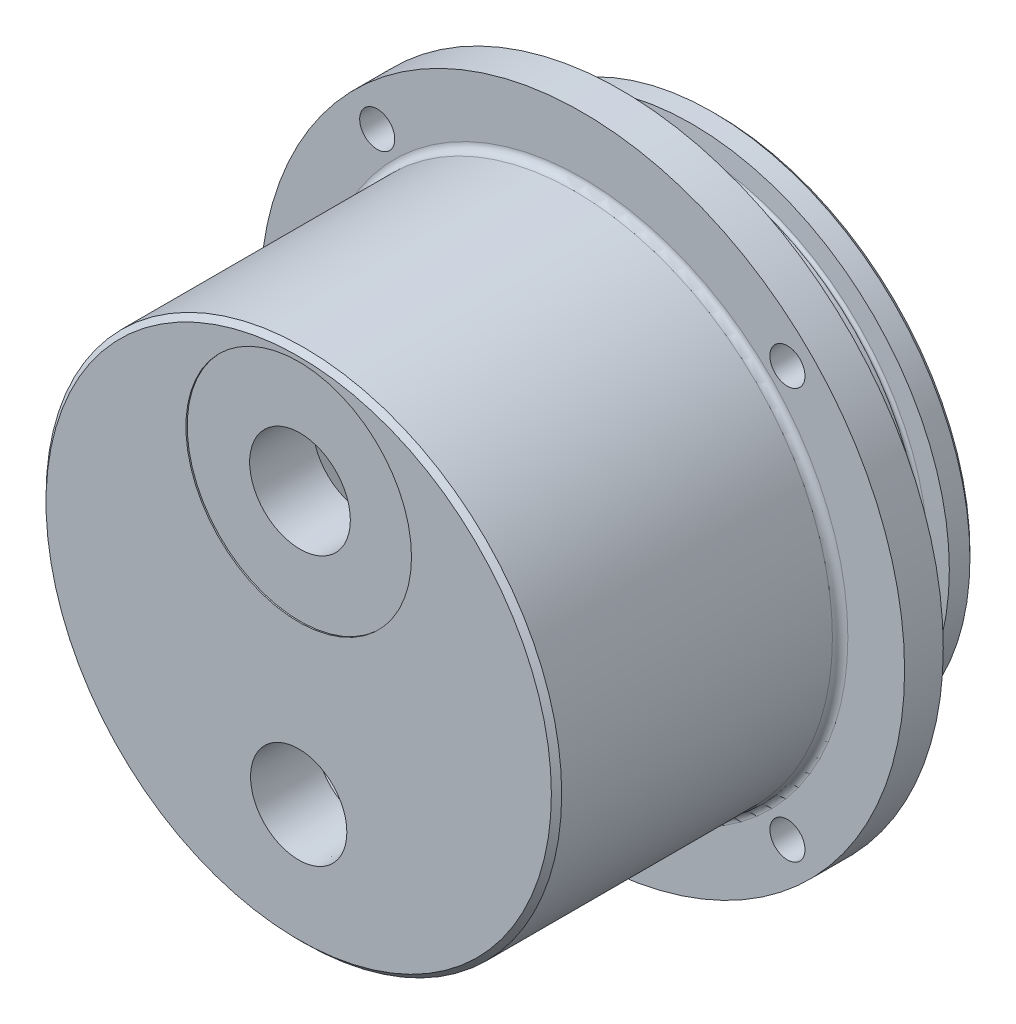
ISO-10303-21;
HEADER;
FILE_DESCRIPTION(('STEP AP214'),'2;1');
FILE_NAME('part.step','',(''),(''),'','','');
FILE_SCHEMA(('AUTOMOTIVE_DESIGN { 1 0 10303 214 1 1 1 1 }'));
ENDSEC;
DATA;
#1=APPLICATION_CONTEXT('core data for automotive mechanical design processes');
#2=APPLICATION_PROTOCOL_DEFINITION('international standard','automotive_design',2000,#1);
#3=PRODUCT_CONTEXT('',#1,'mechanical');
#4=PRODUCT('Part','Part','',(#3));
#5=PRODUCT_RELATED_PRODUCT_CATEGORY('part','',(#4));
#6=PRODUCT_DEFINITION_FORMATION('','',#4);
#7=PRODUCT_DEFINITION_CONTEXT('part definition',#1,'design');
#8=PRODUCT_DEFINITION('design','',#6,#7);
#9=PRODUCT_DEFINITION_SHAPE('','',#8);
#10=(LENGTH_UNIT() NAMED_UNIT(*) SI_UNIT(.MILLI.,.METRE.));
#11=(NAMED_UNIT(*) PLANE_ANGLE_UNIT() SI_UNIT($,.RADIAN.));
#12=(NAMED_UNIT(*) SI_UNIT($,.STERADIAN.) SOLID_ANGLE_UNIT());
#13=UNCERTAINTY_MEASURE_WITH_UNIT(LENGTH_MEASURE(1.E-05),#10,'distance_accuracy_value','');
#14=(GEOMETRIC_REPRESENTATION_CONTEXT(3) GLOBAL_UNCERTAINTY_ASSIGNED_CONTEXT((#13)) GLOBAL_UNIT_ASSIGNED_CONTEXT((#10,
#11,#12)) REPRESENTATION_CONTEXT('',''));
#15=CARTESIAN_POINT('',(0.,0.,0.));
#16=DIRECTION('',(0.,0.,1.));
#17=DIRECTION('',(1.,0.,0.));
#18=AXIS2_PLACEMENT_3D('',#15,#16,#17);
#19=CARTESIAN_POINT('',(0.,13.335,31.75));
#20=DIRECTION('',(0.,0.,1.));
#21=DIRECTION('',(1.,0.,0.));
#22=AXIS2_PLACEMENT_3D('',#19,#20,#21);
#23=CYLINDRICAL_SURFACE('',#22,4.96061999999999);
#24=CARTESIAN_POINT('',(0.,13.335,25.4));
#25=DIRECTION('',(0.,0.,1.));
#26=DIRECTION('',(1.,0.,0.));
#27=AXIS2_PLACEMENT_3D('',#24,#25,#26);
#28=CIRCLE('',#27,4.96061999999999);
#29=CARTESIAN_POINT('',(0.321857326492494,18.2851675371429,25.4));
#30=VERTEX_POINT('',#29);
#31=CARTESIAN_POINT('',(-0.321857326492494,18.2851675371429,25.4));
#32=VERTEX_POINT('',#31);
#33=EDGE_CURVE('E84',#30,#32,#28,.T.);
#34=ORIENTED_EDGE('',*,*,#33,.F.);
#35=EDGE_CURVE('E94',#32,#30,#28,.T.);
#36=ORIENTED_EDGE('',*,*,#35,.F.);
#37=EDGE_LOOP('',(#34,#36));
#38=FACE_BOUND('',#37,.T.);
#39=CARTESIAN_POINT('',(0.,13.335,31.623));
#40=DIRECTION('',(0.,0.,1.));
#41=DIRECTION('',(1.,0.,0.));
#42=AXIS2_PLACEMENT_3D('',#39,#40,#41);
#43=CIRCLE('',#42,4.96061999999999);
#44=CARTESIAN_POINT('',(4.96061999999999,13.335,31.623));
#45=VERTEX_POINT('',#44);
#46=EDGE_CURVE('E177',#45,#45,#43,.F.);
#47=ORIENTED_EDGE('',*,*,#46,.F.);
#48=EDGE_LOOP('',(#47));
#49=FACE_BOUND('',#48,.T.);
#50=ADVANCED_FACE('F53',(#38,#49),#23,.F.);
#51=CARTESIAN_POINT('',(0.,0.,25.4));
#52=DIRECTION('',(0.,0.,-1.));
#53=DIRECTION('',(-1.,0.,0.));
#54=AXIS2_PLACEMENT_3D('',#51,#52,#53);
#55=CYLINDRICAL_SURFACE('',#54,31.75);
#56=CARTESIAN_POINT('',(0.,0.,0.));
#57=DIRECTION('',(0.,0.,1.));
#58=DIRECTION('',(1.,0.,0.));
#59=AXIS2_PLACEMENT_3D('',#56,#57,#58);
#60=CIRCLE('',#59,31.75);
#61=CARTESIAN_POINT('',(31.75,0.,0.));
#62=VERTEX_POINT('',#61);
#63=EDGE_CURVE('E148',#62,#62,#60,.T.);
#64=ORIENTED_EDGE('',*,*,#63,.T.);
#65=EDGE_LOOP('',(#64));
#66=FACE_BOUND('',#65,.T.);
#67=CARTESIAN_POINT('',(0.,0.,3.81));
#68=DIRECTION('',(0.,0.,1.));
#69=DIRECTION('',(1.,0.,0.));
#70=AXIS2_PLACEMENT_3D('',#67,#68,#69);
#71=CIRCLE('',#70,31.75);
#72=CARTESIAN_POINT('',(31.75,0.,3.81));
#73=VERTEX_POINT('',#72);
#74=EDGE_CURVE('E115',#73,#73,#71,.T.);
#75=ORIENTED_EDGE('',*,*,#74,.F.);
#76=EDGE_LOOP('',(#75));
#77=FACE_BOUND('',#76,.T.);
#78=ADVANCED_FACE('F191',(#66,#77),#55,.T.);
#79=CARTESIAN_POINT('',(-20.2055762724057,20.2055762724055,-9.525));
#80=DIRECTION('',(0.,0.,1.));
#81=DIRECTION('',(1.,0.,0.));
#82=AXIS2_PLACEMENT_3D('',#79,#80,#81);
#83=CYLINDRICAL_SURFACE('',#82,1.7272);
#84=CARTESIAN_POINT('',(-20.2055762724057,20.2055762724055,0.));
#85=DIRECTION('',(0.,0.,1.));
#86=DIRECTION('',(1.,0.,0.));
#87=AXIS2_PLACEMENT_3D('',#84,#85,#86);
#88=CIRCLE('',#87,1.7272);
#89=CARTESIAN_POINT('',(-18.4783762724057,20.2055762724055,0.));
#90=VERTEX_POINT('',#89);
#91=EDGE_CURVE('E145',#90,#90,#88,.T.);
#92=ORIENTED_EDGE('',*,*,#91,.F.);
#93=EDGE_LOOP('',(#92));
#94=FACE_BOUND('',#93,.T.);
#95=CARTESIAN_POINT('',(-20.2055762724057,20.2055762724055,3.81));
#96=DIRECTION('',(0.,0.,1.));
#97=DIRECTION('',(1.,0.,0.));
#98=AXIS2_PLACEMENT_3D('',#95,#96,#97);
#99=CIRCLE('',#98,1.7272);
#100=CARTESIAN_POINT('',(-18.4783762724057,20.2055762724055,3.81));
#101=VERTEX_POINT('',#100);
#102=EDGE_CURVE('E112',#101,#101,#99,.F.);
#103=ORIENTED_EDGE('',*,*,#102,.F.);
#104=EDGE_LOOP('',(#103));
#105=FACE_BOUND('',#104,.T.);
#106=ADVANCED_FACE('F284',(#94,#105),#83,.F.);
#107=CARTESIAN_POINT('',(20.2055762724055,20.2055762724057,-9.525));
#108=DIRECTION('',(0.,0.,1.));
#109=DIRECTION('',(1.,0.,0.));
#110=AXIS2_PLACEMENT_3D('',#107,#108,#109);
#111=CYLINDRICAL_SURFACE('',#110,1.7272);
#112=CARTESIAN_POINT('',(20.2055762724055,20.2055762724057,0.));
#113=DIRECTION('',(0.,0.,1.));
#114=DIRECTION('',(1.,0.,0.));
#115=AXIS2_PLACEMENT_3D('',#112,#113,#114);
#116=CIRCLE('',#115,1.7272);
#117=CARTESIAN_POINT('',(21.9327762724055,20.2055762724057,0.));
#118=VERTEX_POINT('',#117);
#119=EDGE_CURVE('E142',#118,#118,#116,.T.);
#120=ORIENTED_EDGE('',*,*,#119,.F.);
#121=EDGE_LOOP('',(#120));
#122=FACE_BOUND('',#121,.T.);
#123=CARTESIAN_POINT('',(20.2055762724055,20.2055762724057,3.81));
#124=DIRECTION('',(0.,0.,1.));
#125=DIRECTION('',(1.,0.,0.));
#126=AXIS2_PLACEMENT_3D('',#123,#124,#125);
#127=CIRCLE('',#126,1.7272);
#128=CARTESIAN_POINT('',(21.9327762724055,20.2055762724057,3.81));
#129=VERTEX_POINT('',#128);
#130=EDGE_CURVE('E109',#129,#129,#127,.F.);
#131=ORIENTED_EDGE('',*,*,#130,.F.);
#132=EDGE_LOOP('',(#131));
#133=FACE_BOUND('',#132,.T.);
#134=ADVANCED_FACE('F280',(#122,#133),#111,.F.);
#135=CARTESIAN_POINT('',(-20.2055762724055,-20.2055762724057,-9.525));
#136=DIRECTION('',(0.,0.,1.));
#137=DIRECTION('',(1.,0.,0.));
#138=AXIS2_PLACEMENT_3D('',#135,#136,#137);
#139=CYLINDRICAL_SURFACE('',#138,1.7272);
#140=CARTESIAN_POINT('',(-20.2055762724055,-20.2055762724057,0.));
#141=DIRECTION('',(0.,0.,1.));
#142=DIRECTION('',(1.,0.,0.));
#143=AXIS2_PLACEMENT_3D('',#140,#141,#142);
#144=CIRCLE('',#143,1.7272);
#145=CARTESIAN_POINT('',(-18.4783762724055,-20.2055762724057,0.));
#146=VERTEX_POINT('',#145);
#147=EDGE_CURVE('E139',#146,#146,#144,.T.);
#148=ORIENTED_EDGE('',*,*,#147,.F.);
#149=EDGE_LOOP('',(#148));
#150=FACE_BOUND('',#149,.T.);
#151=CARTESIAN_POINT('',(-20.2055762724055,-20.2055762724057,3.81));
#152=DIRECTION('',(0.,0.,1.));
#153=DIRECTION('',(1.,0.,0.));
#154=AXIS2_PLACEMENT_3D('',#151,#152,#153);
#155=CIRCLE('',#154,1.7272);
#156=CARTESIAN_POINT('',(-18.4783762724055,-20.2055762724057,3.81));
#157=VERTEX_POINT('',#156);
#158=EDGE_CURVE('E102',#157,#157,#155,.F.);
#159=ORIENTED_EDGE('',*,*,#158,.F.);
#160=EDGE_LOOP('',(#159));
#161=FACE_BOUND('',#160,.T.);
#162=ADVANCED_FACE('F276',(#150,#161),#139,.F.);
#163=CARTESIAN_POINT('',(20.2055762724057,-20.2055762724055,-9.525));
#164=DIRECTION('',(0.,0.,1.));
#165=DIRECTION('',(1.,0.,0.));
#166=AXIS2_PLACEMENT_3D('',#163,#164,#165);
#167=CYLINDRICAL_SURFACE('',#166,1.7272);
#168=CARTESIAN_POINT('',(20.2055762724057,-20.2055762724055,0.));
#169=DIRECTION('',(0.,0.,1.));
#170=DIRECTION('',(1.,0.,0.));
#171=AXIS2_PLACEMENT_3D('',#168,#169,#170);
#172=CIRCLE('',#171,1.7272);
#173=CARTESIAN_POINT('',(21.9327762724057,-20.2055762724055,0.));
#174=VERTEX_POINT('',#173);
#175=EDGE_CURVE('E136',#174,#174,#172,.T.);
#176=ORIENTED_EDGE('',*,*,#175,.F.);
#177=EDGE_LOOP('',(#176));
#178=FACE_BOUND('',#177,.T.);
#179=CARTESIAN_POINT('',(20.2055762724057,-20.2055762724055,3.81));
#180=DIRECTION('',(0.,0.,1.));
#181=DIRECTION('',(1.,0.,0.));
#182=AXIS2_PLACEMENT_3D('',#179,#180,#181);
#183=CIRCLE('',#182,1.7272);
#184=CARTESIAN_POINT('',(21.9327762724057,-20.2055762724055,3.81));
#185=VERTEX_POINT('',#184);
#186=EDGE_CURVE('E100',#185,#185,#183,.F.);
#187=ORIENTED_EDGE('',*,*,#186,.F.);
#188=EDGE_LOOP('',(#187));
#189=FACE_BOUND('',#188,.T.);
#190=ADVANCED_FACE('F272',(#178,#189),#167,.F.);
#191=CARTESIAN_POINT('',(0.,0.,-9.525));
#192=DIRECTION('',(0.,0.,1.));
#193=DIRECTION('',(1.,0.,0.));
#194=AXIS2_PLACEMENT_3D('',#191,#192,#193);
#195=CYLINDRICAL_SURFACE('',#194,25.3619);
#196=CARTESIAN_POINT('',(0.,0.,-6.985));
#197=DIRECTION('',(0.,0.,-1.));
#198=DIRECTION('',(-1.,0.,0.));
#199=AXIS2_PLACEMENT_3D('',#196,#197,#198);
#200=CIRCLE('',#199,25.3619);
#201=CARTESIAN_POINT('',(25.3619,0.,-6.985));
#202=VERTEX_POINT('',#201);
#203=EDGE_CURVE('E127',#202,#202,#200,.T.);
#204=CARTESIAN_POINT('',(0.,0.,-9.017));
#205=DIRECTION('',(0.,0.,1.));
#206=DIRECTION('',(1.,0.,0.));
#207=AXIS2_PLACEMENT_3D('',#204,#205,#206);
#208=CIRCLE('',#207,25.3619);
#209=CARTESIAN_POINT('',(25.3619,0.,-9.017));
#210=VERTEX_POINT('',#209);
#211=EDGE_CURVE('E154',#210,#210,#208,.T.);
#212=CARTESIAN_POINT('',(25.3619,0.,-6.985));
#213=CARTESIAN_POINT('',(25.3619,0.,-7.00616666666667));
#214=CARTESIAN_POINT('',(25.3619,0.,-7.02733333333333));
#215=CARTESIAN_POINT('',(25.3619,0.,-7.06966666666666));
#216=CARTESIAN_POINT('',(25.3619,0.,-7.09083333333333));
#217=CARTESIAN_POINT('',(25.3619,0.,-7.13316666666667));
#218=CARTESIAN_POINT('',(25.3619,0.,-7.15433333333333));
#219=CARTESIAN_POINT('',(25.3619,0.,-7.19666666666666));
#220=CARTESIAN_POINT('',(25.3619,0.,-7.21783333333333));
#221=CARTESIAN_POINT('',(25.3619,0.,-7.26016666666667));
#222=CARTESIAN_POINT('',(25.3619,0.,-7.28133333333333));
#223=CARTESIAN_POINT('',(25.3619,0.,-7.32366666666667));
#224=CARTESIAN_POINT('',(25.3619,0.,-7.34483333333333));
#225=CARTESIAN_POINT('',(25.3619,0.,-7.38716666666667));
#226=CARTESIAN_POINT('',(25.3619,0.,-7.40833333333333));
#227=CARTESIAN_POINT('',(25.3619,0.,-7.45066666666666));
#228=CARTESIAN_POINT('',(25.3619,0.,-7.47183333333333));
#229=CARTESIAN_POINT('',(25.3619,0.,-7.51416666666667));
#230=CARTESIAN_POINT('',(25.3619,0.,-7.53533333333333));
#231=CARTESIAN_POINT('',(25.3619,0.,-7.57766666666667));
#232=CARTESIAN_POINT('',(25.3619,0.,-7.59883333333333));
#233=CARTESIAN_POINT('',(25.3619,0.,-7.64116666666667));
#234=CARTESIAN_POINT('',(25.3619,0.,-7.66233333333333));
#235=CARTESIAN_POINT('',(25.3619,0.,-7.70466666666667));
#236=CARTESIAN_POINT('',(25.3619,0.,-7.72583333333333));
#237=CARTESIAN_POINT('',(25.3619,0.,-7.76816666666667));
#238=CARTESIAN_POINT('',(25.3619,0.,-7.78933333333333));
#239=CARTESIAN_POINT('',(25.3619,0.,-7.83166666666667));
#240=CARTESIAN_POINT('',(25.3619,0.,-7.85283333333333));
#241=CARTESIAN_POINT('',(25.3619,0.,-7.89516666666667));
#242=CARTESIAN_POINT('',(25.3619,0.,-7.91633333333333));
#243=CARTESIAN_POINT('',(25.3619,0.,-7.95866666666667));
#244=CARTESIAN_POINT('',(25.3619,0.,-7.97983333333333));
#245=CARTESIAN_POINT('',(25.3619,0.,-8.02216666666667));
#246=CARTESIAN_POINT('',(25.3619,0.,-8.04333333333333));
#247=CARTESIAN_POINT('',(25.3619,0.,-8.08566666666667));
#248=CARTESIAN_POINT('',(25.3619,0.,-8.10683333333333));
#249=CARTESIAN_POINT('',(25.3619,0.,-8.14916666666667));
#250=CARTESIAN_POINT('',(25.3619,0.,-8.17033333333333));
#251=CARTESIAN_POINT('',(25.3619,0.,-8.21266666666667));
#252=CARTESIAN_POINT('',(25.3619,0.,-8.23383333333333));
#253=CARTESIAN_POINT('',(25.3619,0.,-8.27616666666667));
#254=CARTESIAN_POINT('',(25.3619,0.,-8.29733333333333));
#255=CARTESIAN_POINT('',(25.3619,0.,-8.33966666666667));
#256=CARTESIAN_POINT('',(25.3619,0.,-8.36083333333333));
#257=CARTESIAN_POINT('',(25.3619,0.,-8.40316666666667));
#258=CARTESIAN_POINT('',(25.3619,0.,-8.42433333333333));
#259=CARTESIAN_POINT('',(25.3619,0.,-8.46666666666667));
#260=CARTESIAN_POINT('',(25.3619,0.,-8.48783333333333));
#261=CARTESIAN_POINT('',(25.3619,0.,-8.53016666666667));
#262=CARTESIAN_POINT('',(25.3619,0.,-8.55133333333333));
#263=CARTESIAN_POINT('',(25.3619,0.,-8.59366666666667));
#264=CARTESIAN_POINT('',(25.3619,0.,-8.61483333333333));
#265=CARTESIAN_POINT('',(25.3619,0.,-8.65716666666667));
#266=CARTESIAN_POINT('',(25.3619,0.,-8.67833333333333));
#267=CARTESIAN_POINT('',(25.3619,0.,-8.72066666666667));
#268=CARTESIAN_POINT('',(25.3619,0.,-8.74183333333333));
#269=CARTESIAN_POINT('',(25.3619,0.,-8.78416666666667));
#270=CARTESIAN_POINT('',(25.3619,0.,-8.80533333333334));
#271=CARTESIAN_POINT('',(25.3619,0.,-8.84766666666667));
#272=CARTESIAN_POINT('',(25.3619,0.,-8.86883333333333));
#273=CARTESIAN_POINT('',(25.3619,0.,-8.91116666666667));
#274=CARTESIAN_POINT('',(25.3619,0.,-8.93233333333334));
#275=CARTESIAN_POINT('',(25.3619,0.,-8.97466666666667));
#276=CARTESIAN_POINT('',(25.3619,0.,-8.99583333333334));
#277=CARTESIAN_POINT('',(25.3619,0.,-9.017));
#278=B_SPLINE_CURVE_WITH_KNOTS('',3,(#212,#213,#214,#215,#216,#217,#218,#219,#220,#221,#222,
#223,#224,#225,#226,#227,#228,#229,#230,#231,#232,#233,#234,#235,#236,#237,#238,#239,#240,#241,
#242,#243,#244,#245,#246,#247,#248,#249,#250,#251,#252,#253,#254,#255,#256,#257,#258,#259,#260,
#261,#262,#263,#264,#265,#266,#267,#268,#269,#270,#271,#272,#273,#274,#275,#276,#277),
.UNSPECIFIED.,.F.,.F.,(4,2,2,2,2,2,2,2,2,2,2,2,2,2,2,2,2,2,2,2,2,2,2,2,2,2,2,2,2,2,2,2,4),(0.,
0.0634999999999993,0.127,0.1905,0.254000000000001,0.3175,0.381,0.4445,0.508000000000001,
0.571500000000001,0.635000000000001,0.698500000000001,0.762000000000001,0.825500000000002,
0.889000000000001,0.952500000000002,1.016,1.0795,1.143,1.2065,1.27,1.3335,1.397,1.4605,1.524,
1.5875,1.651,1.7145,1.778,1.8415,1.905,1.9685,2.032),.UNSPECIFIED.);
#279=EDGE_CURVE('BSEAM275',#202,#210,#278,.T.);
#280=ORIENTED_EDGE('',*,*,#203,.T.);
#281=ORIENTED_EDGE('',*,*,#211,.T.);
#282=ORIENTED_EDGE('',*,*,#279,.T.);
#283=ORIENTED_EDGE('',*,*,#279,.F.);
#284=EDGE_LOOP('',(#280,#282,#281,#283));
#285=FACE_BOUND('',#284,.T.);
#286=ADVANCED_FACE('F275',(#285),#195,.T.);
#287=CARTESIAN_POINT('',(0.,0.,-9.525));
#288=DIRECTION('',(0.,0.,1.));
#289=DIRECTION('',(1.,0.,0.));
#290=AXIS2_PLACEMENT_3D('',#287,#288,#289);
#291=PLANE('',#290);
#292=CARTESIAN_POINT('',(0.,0.,-9.525));
#293=DIRECTION('',(0.,0.,1.));
#294=DIRECTION('',(1.,0.,0.));
#295=AXIS2_PLACEMENT_3D('',#292,#293,#294);
#296=CIRCLE('',#295,24.8539);
#297=CARTESIAN_POINT('',(24.8539,0.,-9.525));
#298=VERTEX_POINT('',#297);
#299=EDGE_CURVE('E160',#298,#298,#296,.F.);
#300=ORIENTED_EDGE('',*,*,#299,.T.);
#301=EDGE_LOOP('',(#300));
#302=FACE_BOUND('',#301,.T.);
#303=CARTESIAN_POINT('',(0.,0.,-9.525));
#304=DIRECTION('',(0.,0.,1.));
#305=DIRECTION('',(1.,0.,0.));
#306=AXIS2_PLACEMENT_3D('',#303,#304,#305);
#307=CIRCLE('',#306,19.558);
#308=CARTESIAN_POINT('',(19.558,0.,-9.525));
#309=VERTEX_POINT('',#308);
#310=EDGE_CURVE('E157',#309,#309,#307,.T.);
#311=ORIENTED_EDGE('',*,*,#310,.T.);
#312=EDGE_LOOP('',(#311));
#313=FACE_BOUND('',#312,.T.);
#314=ADVANCED_FACE('F190',(#302,#313),#291,.F.);
#315=CARTESIAN_POINT('',(0.,0.,-9.525));
#316=DIRECTION('',(0.,0.,1.));
#317=DIRECTION('',(1.,0.,0.));
#318=AXIS2_PLACEMENT_3D('',#315,#316,#317);
#319=CYLINDRICAL_SURFACE('',#318,19.05);
#320=CARTESIAN_POINT('',(-1.28931724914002,18.1251369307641,25.4));
#321=CARTESIAN_POINT('',(-1.34869091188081,19.0022168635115,25.5366276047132));
#322=CARTESIAN_POINT('',(-1.37532149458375,19.0002892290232,24.6473871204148));
#323=CARTESIAN_POINT('',(-1.20016904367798,18.1491503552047,25.4));
#324=CARTESIAN_POINT('',(-1.25648920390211,19.0087754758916,25.5131745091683));
#325=CARTESIAN_POINT('',(-1.27526913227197,19.0075317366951,24.6445289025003));
#326=CARTESIAN_POINT('',(-1.10947880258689,18.1708737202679,25.4));
#327=CARTESIAN_POINT('',(-1.16094519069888,19.0148549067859,25.4931030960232));
#328=CARTESIAN_POINT('',(-1.17514102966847,19.0139847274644,24.6425845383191));
#329=CARTESIAN_POINT('',(-0.925641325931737,18.2093934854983,25.4));
#330=CARTESIAN_POINT('',(-0.967871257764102,19.0256326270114,25.4593719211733));
#331=CARTESIAN_POINT('',(-0.97478436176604,19.0253083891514,24.6399002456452));
#332=CARTESIAN_POINT('',(-0.832494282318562,18.2261902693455,25.4));
#333=CARTESIAN_POINT('',(-0.869823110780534,19.030389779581,25.4454860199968));
#334=CARTESIAN_POINT('',(-0.874555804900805,19.0301791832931,24.6391602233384));
#335=CARTESIAN_POINT('',(-0.644454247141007,18.25449911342,25.4));
#336=CARTESIAN_POINT('',(-0.67280880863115,19.0383683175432,25.4229703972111));
#337=CARTESIAN_POINT('',(-0.674138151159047,19.0383320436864,24.6382615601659));
#338=CARTESIAN_POINT('',(-0.549563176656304,18.2660166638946,25.4));
#339=CARTESIAN_POINT('',(-0.573317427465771,19.0416345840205,25.4142001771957));
#340=CARTESIAN_POINT('',(-0.573949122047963,19.0416157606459,24.6381023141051));
#341=CARTESIAN_POINT('',(-0.358627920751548,18.2835679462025,25.4));
#342=CARTESIAN_POINT('',(-0.373984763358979,19.046586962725,25.4011399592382));
#343=CARTESIAN_POINT('',(-0.373529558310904,19.0466013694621,24.6379731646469));
#344=CARTESIAN_POINT('',(-0.262583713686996,18.2896015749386,25.4));
#345=CARTESIAN_POINT('',(-0.27361102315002,19.0482996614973,25.3967772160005));
#346=CARTESIAN_POINT('',(-0.273299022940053,19.04830323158,24.6380032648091));
#347=CARTESIAN_POINT('',(-0.0700743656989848,18.2960598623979,25.4));
#348=CARTESIAN_POINT('',(-0.0730961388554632,19.0501228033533,25.3921377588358));
#349=CARTESIAN_POINT('',(-0.0728294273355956,19.050124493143,24.6380377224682));
#350=CARTESIAN_POINT('',(0.0263907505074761,18.2964848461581,25.4));
#351=CARTESIAN_POINT('',(0.0275789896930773,19.0502430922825,25.3918359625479));
#352=CARTESIAN_POINT('',(0.0274096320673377,19.0502439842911,24.6380420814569));
#353=CARTESIAN_POINT('',(0.21900590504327,18.2917198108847,25.4));
#354=CARTESIAN_POINT('',(0.228166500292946,19.0488985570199,25.3952512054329));
#355=CARTESIAN_POINT('',(0.227876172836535,19.0489007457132,24.6380136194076));
#356=CARTESIAN_POINT('',(0.315155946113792,18.2865298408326,25.4));
#357=CARTESIAN_POINT('',(0.328613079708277,19.0474265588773,25.3989864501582));
#358=CARTESIAN_POINT('',(0.328103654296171,19.0474380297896,24.637980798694));
#359=CARTESIAN_POINT('',(0.50650713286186,18.2706271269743,25.4));
#360=CARTESIAN_POINT('',(0.528296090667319,19.0429358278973,25.4107296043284));
#361=CARTESIAN_POINT('',(0.528625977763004,19.0429283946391,24.6380496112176));
#362=CARTESIAN_POINT('',(0.60170720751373,18.2599087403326,25.4));
#363=CARTESIAN_POINT('',(0.628064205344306,19.0398913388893,25.4188068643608));
#364=CARTESIAN_POINT('',(0.628920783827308,19.0398798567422,24.6381513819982));
#365=CARTESIAN_POINT('',(0.790376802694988,18.2331816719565,25.4));
#366=CARTESIAN_POINT('',(0.825604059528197,19.032367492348,25.439825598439));
#367=CARTESIAN_POINT('',(0.829448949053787,19.032198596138,24.6389024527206));
#368=CARTESIAN_POINT('',(0.883846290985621,18.2171728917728,25.4));
#369=CARTESIAN_POINT('',(0.923906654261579,19.0278474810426,25.4528922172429));
#370=CARTESIAN_POINT('',(0.929682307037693,19.0275658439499,24.6395517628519));
#371=CARTESIAN_POINT('',(0.976107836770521,18.1986369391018,25.4));
#372=CARTESIAN_POINT('',(1.01989202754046,19.0226817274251,25.468681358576));
#373=CARTESIAN_POINT('',(1.02986994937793,19.0221415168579,24.6406812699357));
#374=(BOUNDED_SURFACE() B_SPLINE_SURFACE(3,2,((#320,#321,#322),(#323,#324,#325),(#326,#327,
#328),(#329,#330,#331),(#332,#333,#334),(#335,#336,#337),(#338,#339,#340),(#341,#342,#343),
(#344,#345,#346),(#347,#348,#349),(#350,#351,#352),(#353,#354,#355),(#356,#357,#358),(#359,#360,
#361),(#362,#363,#364),(#365,#366,#367),(#368,#369,#370),(#371,#372,#373)),.UNSPECIFIED.,.F.,
.F.,.F.) B_SPLINE_SURFACE_WITH_KNOTS((4,2,2,2,2,2,2,2,4),(3,3),(0.,0.289011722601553,
0.578000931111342,0.866688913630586,1.15538232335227,1.44405900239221,1.73273316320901,
2.02170255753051,2.31067732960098),(0.,1.),
.UNSPECIFIED.) GEOMETRIC_REPRESENTATION_ITEM() RATIONAL_B_SPLINE_SURFACE(((1.,0.650520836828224,
1.),(1.,0.659400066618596,1.),(1.,0.667258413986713,1.),(1.,0.680987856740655,1.),(1.,
0.686859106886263,1.),(1.,0.696665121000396,1.),(1.,0.700601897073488,1.),(1.,0.706572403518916,
1.),(1.,0.708606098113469,1.),(1.,0.710782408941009,1.),(1.,0.710925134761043,1.),(1.,
0.709320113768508,1.),(1.,0.707572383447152,1.),(1.,0.702175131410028,1.),(1.,0.69852366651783,
1.),(1.,0.689289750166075,1.),(1.,0.683707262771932,1.),(1.,0.677145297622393,1.))) REPRESENTATION_ITEM('') SURFACE());
#375=CARTESIAN_POINT('',(1.02986994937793,19.0221415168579,24.6406812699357));
#376=CARTESIAN_POINT('',(0.929682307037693,19.0275658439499,24.6395517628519));
#377=CARTESIAN_POINT('',(0.829448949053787,19.032198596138,24.6389024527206));
#378=CARTESIAN_POINT('',(0.628920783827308,19.0398798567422,24.6381513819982));
#379=CARTESIAN_POINT('',(0.528625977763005,19.0429283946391,24.6380496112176));
#380=CARTESIAN_POINT('',(0.328103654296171,19.0474380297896,24.637980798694));
#381=CARTESIAN_POINT('',(0.227876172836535,19.0489007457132,24.6380136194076));
#382=CARTESIAN_POINT('',(0.0274096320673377,19.0502439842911,24.6380420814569));
#383=CARTESIAN_POINT('',(-0.0728294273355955,19.050124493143,24.6380377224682));
#384=CARTESIAN_POINT('',(-0.273299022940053,19.04830323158,24.6380032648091));
#385=CARTESIAN_POINT('',(-0.373529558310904,19.0466013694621,24.6379731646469));
#386=CARTESIAN_POINT('',(-0.573949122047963,19.0416157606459,24.6381023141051));
#387=CARTESIAN_POINT('',(-0.674138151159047,19.0383320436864,24.6382615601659));
#388=CARTESIAN_POINT('',(-0.874555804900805,19.0301791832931,24.6391602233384));
#389=CARTESIAN_POINT('',(-0.97478436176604,19.0253083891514,24.6399002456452));
#390=CARTESIAN_POINT('',(-1.17514102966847,19.0139847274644,24.6425845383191));
#391=CARTESIAN_POINT('',(-1.27526913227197,19.0075317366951,24.6445289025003));
#392=CARTESIAN_POINT('',(-1.37532149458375,19.0002892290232,24.6473871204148));
#393=B_SPLINE_CURVE_WITH_KNOTS('',3,(#375,#376,#377,#378,#379,#380,#381,#382,#383,#384,#385,
#386,#387,#388,#389,#390,#391,#392),.UNSPECIFIED.,.F.,.F.,(4,2,2,2,2,2,2,2,4),(0.,
0.28897477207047,0.577944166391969,0.866618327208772,1.15529500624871,1.4439884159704,
1.73267639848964,2.02166560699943,2.31067732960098),.UNSPECIFIED.);
#394=CARTESIAN_POINT('',(0.335268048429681,19.0470495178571,24.638));
#395=VERTEX_POINT('',#394);
#396=CARTESIAN_POINT('',(-0.335268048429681,19.0470495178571,24.638));
#397=VERTEX_POINT('',#396);
#398=EDGE_CURVE('E62',#395,#397,#393,.T.);
#399=ORIENTED_EDGE('',*,*,#398,.T.);
#400=CARTESIAN_POINT('',(0.,0.,24.638));
#401=DIRECTION('',(0.,0.,1.));
#402=DIRECTION('',(1.,0.,0.));
#403=AXIS2_PLACEMENT_3D('',#400,#401,#402);
#404=CIRCLE('',#403,19.05);
#405=EDGE_CURVE('E12',#397,#395,#404,.T.);
#406=ORIENTED_EDGE('',*,*,#405,.T.);
#407=EDGE_LOOP('',(#399,#406));
#408=FACE_BOUND('',#407,.T.);
#409=CARTESIAN_POINT('',(0.,0.,-9.01699999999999));
#410=DIRECTION('',(0.,0.,1.));
#411=DIRECTION('',(1.,0.,0.));
#412=AXIS2_PLACEMENT_3D('',#409,#410,#411);
#413=CIRCLE('',#412,19.05);
#414=CARTESIAN_POINT('',(19.05,0.,-9.01699999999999));
#415=VERTEX_POINT('',#414);
#416=EDGE_CURVE('E163',#415,#415,#413,.F.);
#417=ORIENTED_EDGE('',*,*,#416,.T.);
#418=EDGE_LOOP('',(#417));
#419=FACE_BOUND('',#418,.T.);
#420=ADVANCED_FACE('F185',(#408,#419),#319,.F.);
#421=CARTESIAN_POINT('',(0.,0.,25.4));
#422=DIRECTION('',(0.,0.,1.));
#423=DIRECTION('',(1.,0.,0.));
#424=AXIS2_PLACEMENT_3D('',#421,#422,#423);
#425=PLANE('',#424);
#426=CARTESIAN_POINT('',(0.,-13.335,25.4));
#427=DIRECTION('',(0.,0.,1.));
#428=DIRECTION('',(1.,0.,0.));
#429=AXIS2_PLACEMENT_3D('',#426,#427,#428);
#430=CIRCLE('',#429,4.55261129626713);
#431=CARTESIAN_POINT('',(4.55261129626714,-13.335,25.4));
#432=VERTEX_POINT('',#431);
#433=EDGE_CURVE('E97',#432,#432,#430,.T.);
#434=ORIENTED_EDGE('',*,*,#433,.T.);
#435=EDGE_LOOP('',(#434));
#436=FACE_BOUND('',#435,.T.);
#437=ORIENTED_EDGE('',*,*,#35,.T.);
#438=CARTESIAN_POINT('',(0.,0.,25.4));
#439=DIRECTION('',(0.,0.,1.));
#440=DIRECTION('',(1.,0.,0.));
#441=AXIS2_PLACEMENT_3D('',#438,#439,#440);
#442=CIRCLE('',#441,18.288);
#443=EDGE_CURVE('E87',#30,#32,#442,.F.);
#444=ORIENTED_EDGE('',*,*,#443,.T.);
#445=EDGE_LOOP('',(#437,#444));
#446=FACE_BOUND('',#445,.T.);
#447=ADVANCED_FACE('F95',(#436,#446),#425,.F.);
#448=CARTESIAN_POINT('',(0.,0.,-9.017));
#449=DIRECTION('',(0.,0.,1.));
#450=DIRECTION('',(1.,0.,0.));
#451=AXIS2_PLACEMENT_3D('',#448,#449,#450);
#452=CONICAL_SURFACE('',#451,25.3619,0.78539816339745);
#453=ORIENTED_EDGE('',*,*,#299,.F.);
#454=EDGE_LOOP('',(#453));
#455=FACE_BOUND('',#454,.T.);
#456=ORIENTED_EDGE('',*,*,#211,.F.);
#457=EDGE_LOOP('',(#456));
#458=FACE_BOUND('',#457,.T.);
#459=ADVANCED_FACE('F291',(#455,#458),#452,.T.);
#460=CARTESIAN_POINT('',(0.,0.,-9.525));
#461=DIRECTION('',(0.,0.,-1.));
#462=DIRECTION('',(-1.,0.,0.));
#463=AXIS2_PLACEMENT_3D('',#460,#461,#462);
#464=CONICAL_SURFACE('',#463,19.558,0.78539816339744);
#465=ORIENTED_EDGE('',*,*,#416,.F.);
#466=EDGE_LOOP('',(#465));
#467=FACE_BOUND('',#466,.T.);
#468=ORIENTED_EDGE('',*,*,#310,.F.);
#469=EDGE_LOOP('',(#468));
#470=FACE_BOUND('',#469,.T.);
#471=ADVANCED_FACE('F270',(#467,#470),#464,.F.);
#472=CARTESIAN_POINT('',(0.,0.,-3.51454186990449));
#473=DIRECTION('',(0.,0.,-1.));
#474=DIRECTION('',(-1.,0.,0.));
#475=AXIS2_PLACEMENT_3D('',#472,#473,#474);
#476=TOROIDAL_SURFACE('',#475,23.4442,0.253999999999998);
#477=CARTESIAN_POINT('',(0.,0.,-3.40382583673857));
#478=DIRECTION('',(0.,0.,-1.));
#479=DIRECTION('',(-1.,0.,0.));
#480=AXIS2_PLACEMENT_3D('',#477,#478,#479);
#481=CIRCLE('',#480,23.2156);
#482=CARTESIAN_POINT('',(-23.2156,0.,-3.40382583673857));
#483=VERTEX_POINT('',#482);
#484=EDGE_CURVE('E118',#483,#483,#481,.T.);
#485=ORIENTED_EDGE('',*,*,#484,.F.);
#486=EDGE_LOOP('',(#485));
#487=FACE_BOUND('',#486,.T.);
#488=CARTESIAN_POINT('',(0.,0.,-3.26663013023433));
#489=DIRECTION('',(0.,0.,-1.));
#490=DIRECTION('',(-1.,0.,0.));
#491=AXIS2_PLACEMENT_3D('',#488,#489,#490);
#492=CIRCLE('',#491,23.3889209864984);
#493=CARTESIAN_POINT('',(-23.3889209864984,0.,-3.26663013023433));
#494=VERTEX_POINT('',#493);
#495=EDGE_CURVE('E133',#494,#494,#492,.T.);
#496=ORIENTED_EDGE('',*,*,#495,.T.);
#497=EDGE_LOOP('',(#496));
#498=FACE_BOUND('',#497,.T.);
#499=ADVANCED_FACE('F266',(#487,#498),#476,.F.);
#500=CARTESIAN_POINT('',(0.,0.,-3.09401683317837));
#501=DIRECTION('',(0.,0.,1.));
#502=DIRECTION('',(1.,0.,0.));
#503=AXIS2_PLACEMENT_3D('',#500,#501,#502);
#504=CONICAL_SURFACE('',#503,25.3619,1.48352986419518);
#505=ORIENTED_EDGE('',*,*,#495,.F.);
#506=EDGE_LOOP('',(#505));
#507=FACE_BOUND('',#506,.T.);
#508=CARTESIAN_POINT('',(0.,0.,-3.09401683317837));
#509=DIRECTION('',(0.,0.,-1.));
#510=DIRECTION('',(-1.,0.,0.));
#511=AXIS2_PLACEMENT_3D('',#508,#509,#510);
#512=CIRCLE('',#511,25.3619);
#513=CARTESIAN_POINT('',(25.3619,0.,-3.09401683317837));
#514=VERTEX_POINT('',#513);
#515=EDGE_CURVE('E130',#514,#514,#512,.T.);
#516=ORIENTED_EDGE('',*,*,#515,.T.);
#517=EDGE_LOOP('',(#516));
#518=FACE_BOUND('',#517,.T.);
#519=ADVANCED_FACE('F262',(#507,#518),#504,.T.);
#520=CARTESIAN_POINT('',(0.,0.,-6.81821946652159));
#521=DIRECTION('',(0.,0.,-1.));
#522=DIRECTION('',(-1.,0.,0.));
#523=AXIS2_PLACEMENT_3D('',#520,#521,#522);
#524=CONICAL_SURFACE('',#523,23.4555897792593,1.48352986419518);
#525=ORIENTED_EDGE('',*,*,#203,.F.);
#526=EDGE_LOOP('',(#525));
#527=FACE_BOUND('',#526,.T.);
#528=CARTESIAN_POINT('',(0.,0.,-6.81821946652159));
#529=DIRECTION('',(0.,0.,-1.));
#530=DIRECTION('',(-1.,0.,0.));
#531=AXIS2_PLACEMENT_3D('',#528,#529,#530);
#532=CIRCLE('',#531,23.4555897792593);
#533=CARTESIAN_POINT('',(-23.4555897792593,0.,-6.81821946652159));
#534=VERTEX_POINT('',#533);
#535=EDGE_CURVE('E124',#534,#534,#532,.T.);
#536=ORIENTED_EDGE('',*,*,#535,.T.);
#537=EDGE_LOOP('',(#536));
#538=FACE_BOUND('',#537,.T.);
#539=ADVANCED_FACE('F258',(#527,#538),#524,.T.);
#540=CARTESIAN_POINT('',(0.,0.,-6.56447496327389));
#541=DIRECTION('',(0.,0.,-1.));
#542=DIRECTION('',(-1.,0.,0.));
#543=AXIS2_PLACEMENT_3D('',#540,#541,#542);
#544=TOROIDAL_SURFACE('',#543,23.4442,0.253999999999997);
#545=ORIENTED_EDGE('',*,*,#535,.F.);
#546=EDGE_LOOP('',(#545));
#547=FACE_BOUND('',#546,.T.);
#548=CARTESIAN_POINT('',(0.,0.,-6.45375893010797));
#549=DIRECTION('',(0.,0.,-1.));
#550=DIRECTION('',(-1.,0.,0.));
#551=AXIS2_PLACEMENT_3D('',#548,#549,#550);
#552=CIRCLE('',#551,23.2156);
#553=CARTESIAN_POINT('',(-23.2156,0.,-6.45375893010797));
#554=VERTEX_POINT('',#553);
#555=EDGE_CURVE('E121',#554,#554,#552,.T.);
#556=ORIENTED_EDGE('',*,*,#555,.T.);
#557=EDGE_LOOP('',(#556));
#558=FACE_BOUND('',#557,.T.);
#559=ADVANCED_FACE('F254',(#547,#558),#544,.F.);
#560=CARTESIAN_POINT('',(0.,0.,40.475));
#561=DIRECTION('',(0.,0.,-1.));
#562=DIRECTION('',(-1.,0.,0.));
#563=AXIS2_PLACEMENT_3D('',#560,#561,#562);
#564=CYLINDRICAL_SURFACE('',#563,23.2156);
#565=ORIENTED_EDGE('',*,*,#555,.F.);
#566=EDGE_LOOP('',(#565));
#567=FACE_BOUND('',#566,.T.);
#568=ORIENTED_EDGE('',*,*,#484,.T.);
#569=EDGE_LOOP('',(#568));
#570=FACE_BOUND('',#569,.T.);
#571=ADVANCED_FACE('F250',(#567,#570),#564,.T.);
#572=CARTESIAN_POINT('',(0.,0.,0.));
#573=DIRECTION('',(0.,0.,1.));
#574=DIRECTION('',(1.,0.,0.));
#575=AXIS2_PLACEMENT_3D('',#572,#573,#574);
#576=PLANE('',#575);
#577=ORIENTED_EDGE('',*,*,#175,.T.);
#578=EDGE_LOOP('',(#577));
#579=FACE_BOUND('',#578,.T.);
#580=ORIENTED_EDGE('',*,*,#147,.T.);
#581=EDGE_LOOP('',(#580));
#582=FACE_BOUND('',#581,.T.);
#583=ORIENTED_EDGE('',*,*,#119,.T.);
#584=EDGE_LOOP('',(#583));
#585=FACE_BOUND('',#584,.T.);
#586=ORIENTED_EDGE('',*,*,#91,.T.);
#587=EDGE_LOOP('',(#586));
#588=FACE_BOUND('',#587,.T.);
#589=CARTESIAN_POINT('',(0.,0.,0.));
#590=DIRECTION('',(0.,0.,1.));
#591=DIRECTION('',(1.,0.,0.));
#592=AXIS2_PLACEMENT_3D('',#589,#590,#591);
#593=CIRCLE('',#592,25.3619);
#594=CARTESIAN_POINT('',(25.3619,0.,0.));
#595=VERTEX_POINT('',#594);
#596=EDGE_CURVE('E151',#595,#595,#593,.T.);
#597=ORIENTED_EDGE('',*,*,#596,.T.);
#598=EDGE_LOOP('',(#597));
#599=FACE_BOUND('',#598,.T.);
#600=ORIENTED_EDGE('',*,*,#63,.F.);
#601=EDGE_LOOP('',(#600));
#602=FACE_BOUND('',#601,.T.);
#603=ADVANCED_FACE('F253',(#579,#582,#585,#588,#599,#602),#576,.F.);
#604=CARTESIAN_POINT('',(25.3619,0.,-3.09401683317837));
#605=CARTESIAN_POINT('',(25.3619,0.,-3.0617874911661));
#606=CARTESIAN_POINT('',(25.3619,0.,-3.02955814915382));
#607=CARTESIAN_POINT('',(25.3619,0.,-2.96509946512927));
#608=CARTESIAN_POINT('',(25.3619,0.,-2.932870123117));
#609=CARTESIAN_POINT('',(25.3619,0.,-2.86841143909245));
#610=CARTESIAN_POINT('',(25.3619,0.,-2.83618209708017));
#611=CARTESIAN_POINT('',(25.3619,0.,-2.77172341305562));
#612=CARTESIAN_POINT('',(25.3619,0.,-2.73949407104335));
#613=CARTESIAN_POINT('',(25.3619,0.,-2.6750353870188));
#614=CARTESIAN_POINT('',(25.3619,0.,-2.64280604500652));
#615=CARTESIAN_POINT('',(25.3619,0.,-2.57834736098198));
#616=CARTESIAN_POINT('',(25.3619,0.,-2.5461180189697));
#617=CARTESIAN_POINT('',(25.3619,0.,-2.48165933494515));
#618=CARTESIAN_POINT('',(25.3619,0.,-2.44942999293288));
#619=CARTESIAN_POINT('',(25.3619,0.,-2.38497130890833));
#620=CARTESIAN_POINT('',(25.3619,0.,-2.35274196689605));
#621=CARTESIAN_POINT('',(25.3619,0.,-2.2882832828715));
#622=CARTESIAN_POINT('',(25.3619,0.,-2.25605394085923));
#623=CARTESIAN_POINT('',(25.3619,0.,-2.19159525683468));
#624=CARTESIAN_POINT('',(25.3619,0.,-2.1593659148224));
#625=CARTESIAN_POINT('',(25.3619,0.,-2.09490723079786));
#626=CARTESIAN_POINT('',(25.3619,0.,-2.06267788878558));
#627=CARTESIAN_POINT('',(25.3619,0.,-1.99821920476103));
#628=CARTESIAN_POINT('',(25.3619,0.,-1.96598986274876));
#629=CARTESIAN_POINT('',(25.3619,0.,-1.90153117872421));
#630=CARTESIAN_POINT('',(25.3619,0.,-1.86930183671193));
#631=CARTESIAN_POINT('',(25.3619,0.,-1.80484315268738));
#632=CARTESIAN_POINT('',(25.3619,0.,-1.77261381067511));
#633=CARTESIAN_POINT('',(25.3619,0.,-1.70815512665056));
#634=CARTESIAN_POINT('',(25.3619,0.,-1.67592578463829));
#635=CARTESIAN_POINT('',(25.3619,0.,-1.61146710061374));
#636=CARTESIAN_POINT('',(25.3619,0.,-1.57923775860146));
#637=CARTESIAN_POINT('',(25.3619,0.,-1.51477907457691));
#638=CARTESIAN_POINT('',(25.3619,0.,-1.48254973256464));
#639=CARTESIAN_POINT('',(25.3619,0.,-1.41809104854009));
#640=CARTESIAN_POINT('',(25.3619,0.,-1.38586170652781));
#641=CARTESIAN_POINT('',(25.3619,0.,-1.32140302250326));
#642=CARTESIAN_POINT('',(25.3619,0.,-1.28917368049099));
#643=CARTESIAN_POINT('',(25.3619,0.,-1.22471499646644));
#644=CARTESIAN_POINT('',(25.3619,0.,-1.19248565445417));
#645=CARTESIAN_POINT('',(25.3619,0.,-1.12802697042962));
#646=CARTESIAN_POINT('',(25.3619,0.,-1.09579762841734));
#647=CARTESIAN_POINT('',(25.3619,0.,-1.03133894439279));
#648=CARTESIAN_POINT('',(25.3619,0.,-0.999109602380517));
#649=CARTESIAN_POINT('',(25.3619,0.,-0.934650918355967));
#650=CARTESIAN_POINT('',(25.3619,0.,-0.902421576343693));
#651=CARTESIAN_POINT('',(25.3619,0.,-0.837962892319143));
#652=CARTESIAN_POINT('',(25.3619,0.,-0.805733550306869));
#653=CARTESIAN_POINT('',(25.3619,0.,-0.74127486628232));
#654=CARTESIAN_POINT('',(25.3619,0.,-0.709045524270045));
#655=CARTESIAN_POINT('',(25.3619,0.,-0.644586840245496));
#656=CARTESIAN_POINT('',(25.3619,0.,-0.612357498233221));
#657=CARTESIAN_POINT('',(25.3619,0.,-0.547898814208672));
#658=CARTESIAN_POINT('',(25.3619,0.,-0.515669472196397));
#659=CARTESIAN_POINT('',(25.3619,0.,-0.451210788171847));
#660=CARTESIAN_POINT('',(25.3619,0.,-0.418981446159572));
#661=CARTESIAN_POINT('',(25.3619,0.,-0.354522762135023));
#662=CARTESIAN_POINT('',(25.3619,0.,-0.322293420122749));
#663=CARTESIAN_POINT('',(25.3619,0.,-0.257834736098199));
#664=CARTESIAN_POINT('',(25.3619,0.,-0.225605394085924));
#665=CARTESIAN_POINT('',(25.3619,0.,-0.161146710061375));
#666=CARTESIAN_POINT('',(25.3619,0.,-0.1289173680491));
#667=CARTESIAN_POINT('',(25.3619,0.,-0.0644586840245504));
#668=CARTESIAN_POINT('',(25.3619,0.,-0.0322293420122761));
#669=CARTESIAN_POINT('',(25.3619,0.,0.));
#670=B_SPLINE_CURVE_WITH_KNOTS('',3,(#604,#605,#606,#607,#608,#609,#610,#611,#612,#613,#614,
#615,#616,#617,#618,#619,#620,#621,#622,#623,#624,#625,#626,#627,#628,#629,#630,#631,#632,#633,
#634,#635,#636,#637,#638,#639,#640,#641,#642,#643,#644,#645,#646,#647,#648,#649,#650,#651,#652,
#653,#654,#655,#656,#657,#658,#659,#660,#661,#662,#663,#664,#665,#666,#667,#668,#669),
.UNSPECIFIED.,.F.,.F.,(4,2,2,2,2,2,2,2,2,2,2,2,2,2,2,2,2,2,2,2,2,2,2,2,2,2,2,2,2,2,2,2,4),(0.,
0.0966880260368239,0.193376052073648,0.290064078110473,0.386752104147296,0.48344013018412,
0.580128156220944,0.676816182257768,0.773504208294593,0.870192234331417,0.966880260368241,
1.06356828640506,1.16025631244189,1.25694433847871,1.35363236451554,1.45032039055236,
1.54700841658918,1.64369644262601,1.74038446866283,1.83707249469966,1.93376052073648,
2.03044854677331,2.12713657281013,2.22382459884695,2.32051262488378,2.4172006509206,
2.51388867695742,2.61057670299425,2.70726472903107,2.8039527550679,2.90064078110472,
2.99732880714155,3.09401683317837),.UNSPECIFIED.);
#671=EDGE_CURVE('BSEAM248',#514,#595,#670,.T.);
#672=ORIENTED_EDGE('',*,*,#515,.F.);
#673=ORIENTED_EDGE('',*,*,#596,.F.);
#674=ORIENTED_EDGE('',*,*,#671,.T.);
#675=ORIENTED_EDGE('',*,*,#671,.F.);
#676=EDGE_LOOP('',(#672,#674,#673,#675));
#677=FACE_BOUND('',#676,.T.);
#678=ADVANCED_FACE('F248',(#677),#195,.T.);
#679=CARTESIAN_POINT('',(0.,0.,3.81));
#680=DIRECTION('',(0.,0.,1.));
#681=DIRECTION('',(1.,0.,0.));
#682=AXIS2_PLACEMENT_3D('',#679,#680,#681);
#683=PLANE('',#682);
#684=CARTESIAN_POINT('',(0.,0.,3.81));
#685=DIRECTION('',(0.,0.,1.));
#686=DIRECTION('',(1.,0.,0.));
#687=AXIS2_PLACEMENT_3D('',#684,#685,#686);
#688=CIRCLE('',#687,26.162);
#689=CARTESIAN_POINT('',(26.162,0.,3.81));
#690=VERTEX_POINT('',#689);
#691=EDGE_CURVE('E169',#690,#690,#688,.F.);
#692=ORIENTED_EDGE('',*,*,#691,.T.);
#693=EDGE_LOOP('',(#692));
#694=FACE_BOUND('',#693,.T.);
#695=ORIENTED_EDGE('',*,*,#102,.T.);
#696=EDGE_LOOP('',(#695));
#697=FACE_BOUND('',#696,.T.);
#698=ORIENTED_EDGE('',*,*,#158,.T.);
#699=EDGE_LOOP('',(#698));
#700=FACE_BOUND('',#699,.T.);
#701=ORIENTED_EDGE('',*,*,#186,.T.);
#702=EDGE_LOOP('',(#701));
#703=FACE_BOUND('',#702,.T.);
#704=ORIENTED_EDGE('',*,*,#130,.T.);
#705=EDGE_LOOP('',(#704));
#706=FACE_BOUND('',#705,.T.);
#707=ORIENTED_EDGE('',*,*,#74,.T.);
#708=EDGE_LOOP('',(#707));
#709=FACE_BOUND('',#708,.T.);
#710=ADVANCED_FACE('F244',(#694,#697,#700,#703,#706,#709),#683,.T.);
#711=CARTESIAN_POINT('',(0.,0.,3.81));
#712=DIRECTION('',(0.,0.,1.));
#713=DIRECTION('',(1.,0.,0.));
#714=AXIS2_PLACEMENT_3D('',#711,#712,#713);
#715=CYLINDRICAL_SURFACE('',#714,25.4);
#716=CARTESIAN_POINT('',(0.,0.,31.242));
#717=DIRECTION('',(0.,0.,1.));
#718=DIRECTION('',(1.,0.,0.));
#719=AXIS2_PLACEMENT_3D('',#716,#717,#718);
#720=CIRCLE('',#719,25.4);
#721=CARTESIAN_POINT('',(25.4,0.,31.242));
#722=VERTEX_POINT('',#721);
#723=EDGE_CURVE('E92',#722,#722,#720,.F.);
#724=ORIENTED_EDGE('',*,*,#723,.T.);
#725=EDGE_LOOP('',(#724));
#726=FACE_BOUND('',#725,.T.);
#727=CARTESIAN_POINT('',(0.,0.,4.572));
#728=DIRECTION('',(0.,0.,1.));
#729=DIRECTION('',(1.,0.,0.));
#730=AXIS2_PLACEMENT_3D('',#727,#728,#729);
#731=CIRCLE('',#730,25.4);
#732=CARTESIAN_POINT('',(25.4,0.,4.572));
#733=VERTEX_POINT('',#732);
#734=EDGE_CURVE('E165',#733,#733,#731,.T.);
#735=ORIENTED_EDGE('',*,*,#734,.T.);
#736=EDGE_LOOP('',(#735));
#737=FACE_BOUND('',#736,.T.);
#738=ADVANCED_FACE('F241',(#726,#737),#715,.T.);
#739=CARTESIAN_POINT('',(0.,0.,31.75));
#740=DIRECTION('',(0.,0.,1.));
#741=DIRECTION('',(1.,0.,0.));
#742=AXIS2_PLACEMENT_3D('',#739,#740,#741);
#743=PLANE('',#742);
#744=CARTESIAN_POINT('',(0.,13.335,31.75));
#745=DIRECTION('',(0.,0.,1.));
#746=DIRECTION('',(1.,0.,0.));
#747=AXIS2_PLACEMENT_3D('',#744,#745,#746);
#748=CIRCLE('',#747,11.1125);
#749=CARTESIAN_POINT('',(11.1125,13.335,31.75));
#750=VERTEX_POINT('',#749);
#751=EDGE_CURVE('E211',#750,#750,#748,.T.);
#752=ORIENTED_EDGE('',*,*,#751,.F.);
#753=EDGE_LOOP('',(#752));
#754=FACE_BOUND('',#753,.T.);
#755=CARTESIAN_POINT('',(0.,-13.335,31.75));
#756=DIRECTION('',(0.,0.,1.));
#757=DIRECTION('',(1.,0.,0.));
#758=AXIS2_PLACEMENT_3D('',#755,#756,#757);
#759=CIRCLE('',#758,4.7427388);
#760=CARTESIAN_POINT('',(4.74273880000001,-13.335,31.75));
#761=VERTEX_POINT('',#760);
#762=EDGE_CURVE('E179',#761,#761,#759,.T.);
#763=ORIENTED_EDGE('',*,*,#762,.F.);
#764=EDGE_LOOP('',(#763));
#765=FACE_BOUND('',#764,.T.);
#766=CARTESIAN_POINT('',(0.,0.,31.75));
#767=DIRECTION('',(0.,0.,1.));
#768=DIRECTION('',(1.,0.,0.));
#769=AXIS2_PLACEMENT_3D('',#766,#767,#768);
#770=CIRCLE('',#769,24.892);
#771=CARTESIAN_POINT('',(24.892,0.,31.75));
#772=VERTEX_POINT('',#771);
#773=EDGE_CURVE('E172',#772,#772,#770,.T.);
#774=ORIENTED_EDGE('',*,*,#773,.T.);
#775=EDGE_LOOP('',(#774));
#776=FACE_BOUND('',#775,.T.);
#777=ADVANCED_FACE('F239',(#754,#765,#776),#743,.T.);
#778=CARTESIAN_POINT('',(0.,0.,4.572));
#779=DIRECTION('',(0.,0.,1.));
#780=DIRECTION('',(1.,0.,0.));
#781=AXIS2_PLACEMENT_3D('',#778,#779,#780);
#782=TOROIDAL_SURFACE('',#781,26.162,0.762);
#783=ORIENTED_EDGE('',*,*,#691,.F.);
#784=EDGE_LOOP('',(#783));
#785=FACE_BOUND('',#784,.T.);
#786=ORIENTED_EDGE('',*,*,#734,.F.);
#787=EDGE_LOOP('',(#786));
#788=FACE_BOUND('',#787,.T.);
#789=ADVANCED_FACE('F235',(#785,#788),#782,.F.);
#790=CARTESIAN_POINT('',(0.,0.,31.75));
#791=DIRECTION('',(0.,0.,-1.));
#792=DIRECTION('',(-1.,0.,0.));
#793=AXIS2_PLACEMENT_3D('',#790,#791,#792);
#794=CONICAL_SURFACE('',#793,24.892,0.785398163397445);
#795=ORIENTED_EDGE('',*,*,#723,.F.);
#796=EDGE_LOOP('',(#795));
#797=FACE_BOUND('',#796,.T.);
#798=ORIENTED_EDGE('',*,*,#773,.F.);
#799=EDGE_LOOP('',(#798));
#800=FACE_BOUND('',#799,.T.);
#801=ADVANCED_FACE('F228',(#797,#800),#794,.T.);
#802=CARTESIAN_POINT('',(0.,-13.335,31.75));
#803=DIRECTION('',(0.,0.,1.));
#804=DIRECTION('',(1.,0.,0.));
#805=AXIS2_PLACEMENT_3D('',#802,#803,#804);
#806=CONICAL_SURFACE('',#805,4.7427388,0.0299323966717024);
#807=ORIENTED_EDGE('',*,*,#762,.T.);
#808=EDGE_LOOP('',(#807));
#809=FACE_BOUND('',#808,.T.);
#810=ORIENTED_EDGE('',*,*,#433,.F.);
#811=EDGE_LOOP('',(#810));
#812=FACE_BOUND('',#811,.T.);
#813=ADVANCED_FACE('F222',(#809,#812),#806,.F.);
#814=CARTESIAN_POINT('',(0.,13.335,31.623));
#815=DIRECTION('',(0.,0.,1.));
#816=DIRECTION('',(1.,0.,0.));
#817=AXIS2_PLACEMENT_3D('',#814,#815,#816);
#818=PLANE('',#817);
#819=CARTESIAN_POINT('',(0.,13.335,31.623));
#820=DIRECTION('',(0.,0.,1.));
#821=DIRECTION('',(1.,0.,0.));
#822=AXIS2_PLACEMENT_3D('',#819,#820,#821);
#823=CIRCLE('',#822,11.1125);
#824=CARTESIAN_POINT('',(11.1125,13.335,31.623));
#825=VERTEX_POINT('',#824);
#826=EDGE_CURVE('E180',#825,#825,#823,.T.);
#827=ORIENTED_EDGE('',*,*,#826,.T.);
#828=EDGE_LOOP('',(#827));
#829=FACE_BOUND('',#828,.T.);
#830=ORIENTED_EDGE('',*,*,#46,.T.);
#831=EDGE_LOOP('',(#830));
#832=FACE_BOUND('',#831,.T.);
#833=ADVANCED_FACE('F219',(#829,#832),#818,.T.);
#834=CARTESIAN_POINT('',(0.,13.335,31.623));
#835=DIRECTION('',(0.,0.,1.));
#836=DIRECTION('',(1.,0.,0.));
#837=AXIS2_PLACEMENT_3D('',#834,#835,#836);
#838=CYLINDRICAL_SURFACE('',#837,11.1125);
#839=ORIENTED_EDGE('',*,*,#826,.F.);
#840=EDGE_LOOP('',(#839));
#841=FACE_BOUND('',#840,.T.);
#842=ORIENTED_EDGE('',*,*,#751,.T.);
#843=EDGE_LOOP('',(#842));
#844=FACE_BOUND('',#843,.T.);
#845=ADVANCED_FACE('F218',(#841,#844),#838,.F.);
#846=CARTESIAN_POINT('',(0.,0.,24.638));
#847=DIRECTION('',(0.,0.,1.));
#848=DIRECTION('',(1.,0.,0.));
#849=AXIS2_PLACEMENT_3D('',#846,#847,#848);
#850=TOROIDAL_SURFACE('',#849,18.288,0.762);
#851=CARTESIAN_POINT('',(0.321857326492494,18.2851675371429,24.638));
#852=DIRECTION('',(0.999845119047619,-0.0175993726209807,0.));
#853=DIRECTION('',(0.0175993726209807,0.999845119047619,0.));
#854=AXIS2_PLACEMENT_3D('',#851,#852,#853);
#855=CIRCLE('',#854,0.762);
#856=EDGE_CURVE('E80',#395,#30,#855,.T.);
#857=ORIENTED_EDGE('',*,*,#856,.F.);
#858=ORIENTED_EDGE('',*,*,#405,.F.);
#859=CARTESIAN_POINT('',(-0.321857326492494,18.2851675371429,24.638));
#860=DIRECTION('',(-0.999845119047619,-0.0175993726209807,0.));
#861=DIRECTION('',(0.0175993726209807,-0.999845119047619,0.));
#862=AXIS2_PLACEMENT_3D('',#859,#860,#861);
#863=CIRCLE('',#862,0.762);
#864=EDGE_CURVE('E69',#32,#397,#863,.T.);
#865=ORIENTED_EDGE('',*,*,#864,.F.);
#866=ORIENTED_EDGE('',*,*,#443,.F.);
#867=EDGE_LOOP('',(#857,#858,#865,#866));
#868=FACE_BOUND('',#867,.T.);
#869=ADVANCED_FACE('F89',(#868),#850,.F.);
#870=ORIENTED_EDGE('',*,*,#864,.T.);
#871=ORIENTED_EDGE('',*,*,#398,.F.);
#872=ORIENTED_EDGE('',*,*,#856,.T.);
#873=ORIENTED_EDGE('',*,*,#33,.T.);
#874=EDGE_LOOP('',(#870,#871,#872,#873));
#875=FACE_BOUND('',#874,.T.);
#876=ADVANCED_FACE('F82',(#875),#374,.F.);
#877=CLOSED_SHELL('',(#50,#78,#106,#134,#162,#190,#286,#314,#420,#447,#459,#471,#499,#519,#539,
#559,#571,#603,#678,#710,#738,#777,#789,#801,#813,#833,#845,#869,#876));
#878=MANIFOLD_SOLID_BREP('B2',#877);
#879=ADVANCED_BREP_SHAPE_REPRESENTATION('',(#18,#878),#14);
#880=SHAPE_DEFINITION_REPRESENTATION(#9,#879);
ENDSEC;
END-ISO-10303-21;
